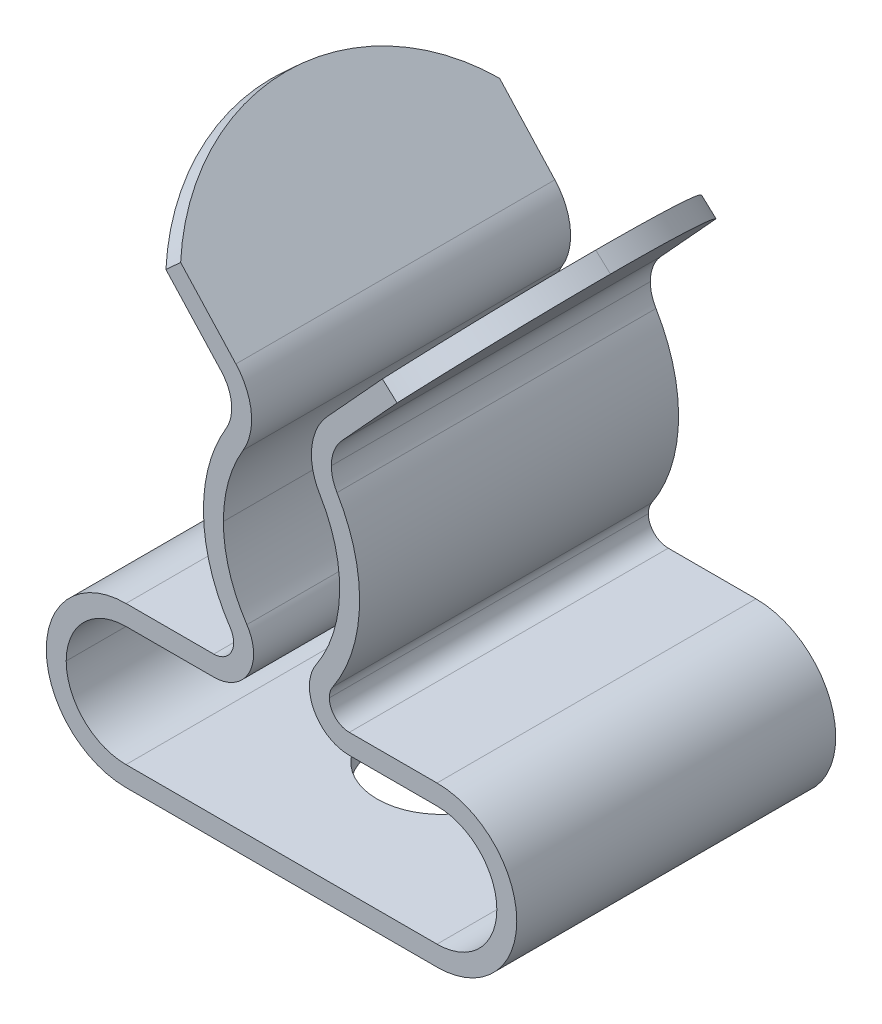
ISO-10303-21;
HEADER;
FILE_DESCRIPTION(('STEP AP214'),'2;1');
FILE_NAME('part.step','',(''),(''),'','','');
FILE_SCHEMA(('AUTOMOTIVE_DESIGN { 1 0 10303 214 1 1 1 1 }'));
ENDSEC;
DATA;
#1=APPLICATION_CONTEXT('core data for automotive mechanical design processes');
#2=APPLICATION_PROTOCOL_DEFINITION('international standard','automotive_design',2000,#1);
#3=PRODUCT_CONTEXT('',#1,'mechanical');
#4=PRODUCT('Part','Part','',(#3));
#5=PRODUCT_RELATED_PRODUCT_CATEGORY('part','',(#4));
#6=PRODUCT_DEFINITION_FORMATION('','',#4);
#7=PRODUCT_DEFINITION_CONTEXT('part definition',#1,'design');
#8=PRODUCT_DEFINITION('design','',#6,#7);
#9=PRODUCT_DEFINITION_SHAPE('','',#8);
#10=(LENGTH_UNIT() NAMED_UNIT(*) SI_UNIT(.MILLI.,.METRE.));
#11=(NAMED_UNIT(*) PLANE_ANGLE_UNIT() SI_UNIT($,.RADIAN.));
#12=(NAMED_UNIT(*) SI_UNIT($,.STERADIAN.) SOLID_ANGLE_UNIT());
#13=UNCERTAINTY_MEASURE_WITH_UNIT(LENGTH_MEASURE(1.E-05),#10,'distance_accuracy_value','');
#14=(GEOMETRIC_REPRESENTATION_CONTEXT(3) GLOBAL_UNCERTAINTY_ASSIGNED_CONTEXT((#13)) GLOBAL_UNIT_ASSIGNED_CONTEXT((#10,
#11,#12)) REPRESENTATION_CONTEXT('',''));
#15=CARTESIAN_POINT('',(0.,0.,0.));
#16=DIRECTION('',(0.,0.,1.));
#17=DIRECTION('',(1.,0.,0.));
#18=AXIS2_PLACEMENT_3D('',#15,#16,#17);
#19=CARTESIAN_POINT('',(0.,0.,4.));
#20=DIRECTION('',(0.,-1.,0.));
#21=DIRECTION('',(0.,0.,-1.));
#22=AXIS2_PLACEMENT_3D('',#19,#20,#21);
#23=CYLINDRICAL_SURFACE('',#22,1.6);
#24=DIRECTION('',(0.,-1.,0.));
#25=VECTOR('',#24,1.);
#26=CARTESIAN_POINT('',(0.,0.,5.6));
#27=LINE('',#26,#25);
#28=CARTESIAN_POINT('',(0.,0.5,5.6));
#29=VERTEX_POINT('',#28);
#30=CARTESIAN_POINT('',(0.,0.,5.6));
#31=VERTEX_POINT('',#30);
#32=EDGE_CURVE('E355',#29,#31,#27,.T.);
#33=ORIENTED_EDGE('',*,*,#32,.F.);
#34=CARTESIAN_POINT('',(0.,0.5,4.));
#35=DIRECTION('',(0.,1.,0.));
#36=DIRECTION('',(0.,0.,1.));
#37=AXIS2_PLACEMENT_3D('',#34,#35,#36);
#38=CIRCLE('',#37,1.6);
#39=CARTESIAN_POINT('',(0.,0.5,2.4));
#40=VERTEX_POINT('',#39);
#41=EDGE_CURVE('E350',#29,#40,#38,.T.);
#42=ORIENTED_EDGE('',*,*,#41,.T.);
#43=DIRECTION('',(0.,-1.,0.));
#44=VECTOR('',#43,1.);
#45=CARTESIAN_POINT('',(0.,0.,2.4));
#46=LINE('',#45,#44);
#47=CARTESIAN_POINT('',(0.,0.,2.4));
#48=VERTEX_POINT('',#47);
#49=EDGE_CURVE('E352',#40,#48,#46,.T.);
#50=ORIENTED_EDGE('',*,*,#49,.T.);
#51=CARTESIAN_POINT('',(0.,0.,4.));
#52=DIRECTION('',(0.,-1.,0.));
#53=DIRECTION('',(0.,0.,-1.));
#54=AXIS2_PLACEMENT_3D('',#51,#52,#53);
#55=CIRCLE('',#54,1.6);
#56=EDGE_CURVE('E475',#48,#31,#55,.T.);
#57=ORIENTED_EDGE('',*,*,#56,.T.);
#58=EDGE_LOOP('',(#33,#42,#50,#57));
#59=FACE_BOUND('',#58,.T.);
#60=ADVANCED_FACE('F15',(#59),#23,.F.);
#61=CARTESIAN_POINT('',(4.81352127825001,14.7517607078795,4.));
#62=DIRECTION('',(-0.737277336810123,-0.675590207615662,0.));
#63=DIRECTION('',(0.675590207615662,-0.737277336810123,0.));
#64=AXIS2_PLACEMENT_3D('',#61,#62,#63);
#65=CYLINDRICAL_SURFACE('',#64,5.);
#66=CARTESIAN_POINT('',(-0.50341029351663,9.87969055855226,4.));
#67=DIRECTION('',(-0.737277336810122,-0.675590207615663,0.));
#68=DIRECTION('',(-0.675590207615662,0.737277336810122,0.));
#69=AXIS2_PLACEMENT_3D('',#66,#67,#68);
#70=CIRCLE('',#69,5.);
#71=CARTESIAN_POINT('',(-2.53018091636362,12.0915225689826,8.));
#72=VERTEX_POINT('',#71);
#73=CARTESIAN_POINT('',(-2.53018091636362,12.0915225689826,0.));
#74=VERTEX_POINT('',#73);
#75=EDGE_CURVE('E412',#72,#74,#70,.T.);
#76=ORIENTED_EDGE('',*,*,#75,.T.);
#77=DIRECTION('',(-0.737277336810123,-0.675590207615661,0.));
#78=VECTOR('',#77,1.);
#79=CARTESIAN_POINT('',(2.78675065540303,16.9635927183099,0.));
#80=LINE('',#79,#78);
#81=CARTESIAN_POINT('',(-2.89881958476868,11.7537274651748,0.));
#82=VERTEX_POINT('',#81);
#83=EDGE_CURVE('E626',#74,#82,#80,.T.);
#84=ORIENTED_EDGE('',*,*,#83,.T.);
#85=CARTESIAN_POINT('',(-0.872048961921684,9.54189545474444,4.));
#86=DIRECTION('',(0.737277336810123,0.675590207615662,0.));
#87=DIRECTION('',(0.675590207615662,-0.737277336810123,0.));
#88=AXIS2_PLACEMENT_3D('',#85,#86,#87);
#89=CIRCLE('',#88,5.);
#90=CARTESIAN_POINT('',(-2.89881958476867,11.7537274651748,8.));
#91=VERTEX_POINT('',#90);
#92=EDGE_CURVE('E574',#82,#91,#89,.T.);
#93=ORIENTED_EDGE('',*,*,#92,.T.);
#94=DIRECTION('',(-0.737277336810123,-0.675590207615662,0.));
#95=VECTOR('',#94,1.);
#96=CARTESIAN_POINT('',(2.78675065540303,16.9635927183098,8.));
#97=LINE('',#96,#95);
#98=EDGE_CURVE('E498',#72,#91,#97,.T.);
#99=ORIENTED_EDGE('',*,*,#98,.F.);
#100=EDGE_LOOP('',(#76,#84,#93,#99));
#101=FACE_BOUND('',#100,.T.);
#102=ADVANCED_FACE('F823',(#101),#65,.T.);
#103=CARTESIAN_POINT('',(-4.81352127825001,14.7517607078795,4.));
#104=DIRECTION('',(0.737277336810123,-0.675590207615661,0.));
#105=DIRECTION('',(0.675590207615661,0.737277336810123,0.));
#106=AXIS2_PLACEMENT_3D('',#103,#104,#105);
#107=CYLINDRICAL_SURFACE('',#106,5.);
#108=DIRECTION('',(0.737277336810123,-0.675590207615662,0.));
#109=VECTOR('',#108,1.);
#110=CARTESIAN_POINT('',(-1.4355702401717,18.4381473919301,4.));
#111=LINE('',#110,#109);
#112=CARTESIAN_POINT('',(3.88136133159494,13.5660772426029,4.));
#113=VERTEX_POINT('',#112);
#114=CARTESIAN_POINT('',(4.25,13.228282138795,4.));
#115=VERTEX_POINT('',#114);
#116=EDGE_CURVE('E402',#113,#115,#111,.T.);
#117=ORIENTED_EDGE('',*,*,#116,.F.);
#118=CARTESIAN_POINT('',(0.503410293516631,9.87969055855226,4.));
#119=DIRECTION('',(0.737277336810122,-0.675590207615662,0.));
#120=DIRECTION('',(-0.675590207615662,-0.737277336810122,0.));
#121=AXIS2_PLACEMENT_3D('',#118,#119,#120);
#122=CIRCLE('',#121,5.);
#123=CARTESIAN_POINT('',(2.53018091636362,12.0915225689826,8.));
#124=VERTEX_POINT('',#123);
#125=EDGE_CURVE('E709',#113,#124,#122,.T.);
#126=ORIENTED_EDGE('',*,*,#125,.T.);
#127=DIRECTION('',(0.737277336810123,-0.675590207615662,0.));
#128=VECTOR('',#127,1.);
#129=CARTESIAN_POINT('',(-2.78675065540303,16.9635927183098,8.));
#130=LINE('',#129,#128);
#131=CARTESIAN_POINT('',(2.89881958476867,11.7537274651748,8.));
#132=VERTEX_POINT('',#131);
#133=EDGE_CURVE('E382',#124,#132,#130,.T.);
#134=ORIENTED_EDGE('',*,*,#133,.T.);
#135=CARTESIAN_POINT('',(0.872048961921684,9.54189545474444,4.));
#136=DIRECTION('',(-0.737277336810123,0.675590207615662,0.));
#137=DIRECTION('',(-0.675590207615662,-0.737277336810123,0.));
#138=AXIS2_PLACEMENT_3D('',#135,#136,#137);
#139=CIRCLE('',#138,5.);
#140=EDGE_CURVE('E434',#132,#115,#139,.T.);
#141=ORIENTED_EDGE('',*,*,#140,.T.);
#142=EDGE_LOOP('',(#117,#126,#134,#141));
#143=FACE_BOUND('',#142,.T.);
#144=ADVANCED_FACE('F827',(#143),#107,.T.);
#145=CARTESIAN_POINT('',(2.25,9.56547790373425,8.));
#146=DIRECTION('',(0.,0.,-1.));
#147=DIRECTION('',(-1.,0.,0.));
#148=AXIS2_PLACEMENT_3D('',#145,#146,#147);
#149=CYLINDRICAL_SURFACE('',#148,1.);
#150=DIRECTION('',(0.,0.,-1.));
#151=VECTOR('',#150,1.);
#152=CARTESIAN_POINT('',(1.25,9.56547790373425,8.));
#153=LINE('',#152,#151);
#154=CARTESIAN_POINT('',(1.25,9.56547790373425,8.));
#155=VERTEX_POINT('',#154);
#156=CARTESIAN_POINT('',(1.25,9.56547790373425,0.));
#157=VERTEX_POINT('',#156);
#158=EDGE_CURVE('E387',#155,#157,#153,.T.);
#159=ORIENTED_EDGE('',*,*,#158,.F.);
#160=CARTESIAN_POINT('',(2.25,9.56547790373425,8.));
#161=DIRECTION('',(0.,0.,-1.));
#162=DIRECTION('',(-1.,0.,0.));
#163=AXIS2_PLACEMENT_3D('',#160,#161,#162);
#164=CIRCLE('',#163,1.);
#165=CARTESIAN_POINT('',(1.39166852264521,9.0523823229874,8.));
#166=VERTEX_POINT('',#165);
#167=EDGE_CURVE('E546',#166,#155,#164,.T.);
#168=ORIENTED_EDGE('',*,*,#167,.F.);
#169=DIRECTION('',(0.,0.,-1.));
#170=VECTOR('',#169,1.);
#171=CARTESIAN_POINT('',(1.39166852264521,9.0523823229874,8.));
#172=LINE('',#171,#170);
#173=CARTESIAN_POINT('',(1.39166852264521,9.0523823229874,0.));
#174=VERTEX_POINT('',#173);
#175=EDGE_CURVE('E9',#166,#174,#172,.T.);
#176=ORIENTED_EDGE('',*,*,#175,.T.);
#177=CARTESIAN_POINT('',(2.25,9.56547790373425,0.));
#178=DIRECTION('',(0.,0.,-1.));
#179=DIRECTION('',(-1.,0.,0.));
#180=AXIS2_PLACEMENT_3D('',#177,#178,#179);
#181=CIRCLE('',#180,1.);
#182=EDGE_CURVE('E383',#174,#157,#181,.T.);
#183=ORIENTED_EDGE('',*,*,#182,.T.);
#184=EDGE_LOOP('',(#159,#168,#176,#183));
#185=FACE_BOUND('',#184,.T.);
#186=ADVANCED_FACE('F832',(#185),#149,.F.);
#187=CARTESIAN_POINT('',(-2.04165738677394,7.,8.));
#188=DIRECTION('',(0.,0.,-1.));
#189=DIRECTION('',(-1.,0.,0.));
#190=AXIS2_PLACEMENT_3D('',#187,#188,#189);
#191=CYLINDRICAL_SURFACE('',#190,4.);
#192=CARTESIAN_POINT('',(-2.04165738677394,7.,0.));
#193=DIRECTION('',(0.,0.,1.));
#194=DIRECTION('',(1.,0.,0.));
#195=AXIS2_PLACEMENT_3D('',#192,#193,#194);
#196=CIRCLE('',#195,4.);
#197=CARTESIAN_POINT('',(1.28426029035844,4.77777777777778,0.));
#198=VERTEX_POINT('',#197);
#199=EDGE_CURVE('E384',#198,#174,#196,.T.);
#200=ORIENTED_EDGE('',*,*,#199,.T.);
#201=ORIENTED_EDGE('',*,*,#175,.F.);
#202=CARTESIAN_POINT('',(-2.04165738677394,7.,8.));
#203=DIRECTION('',(0.,0.,1.));
#204=DIRECTION('',(1.,0.,0.));
#205=AXIS2_PLACEMENT_3D('',#202,#203,#204);
#206=CIRCLE('',#205,4.);
#207=CARTESIAN_POINT('',(1.28426029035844,4.77777777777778,8.));
#208=VERTEX_POINT('',#207);
#209=EDGE_CURVE('E542',#208,#166,#206,.T.);
#210=ORIENTED_EDGE('',*,*,#209,.F.);
#211=DIRECTION('',(0.,0.,-1.));
#212=VECTOR('',#211,1.);
#213=CARTESIAN_POINT('',(1.28426029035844,4.77777777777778,8.));
#214=LINE('',#213,#212);
#215=EDGE_CURVE('E439',#208,#198,#214,.T.);
#216=ORIENTED_EDGE('',*,*,#215,.T.);
#217=EDGE_LOOP('',(#200,#201,#210,#216));
#218=FACE_BOUND('',#217,.T.);
#219=ADVANCED_FACE('F838',(#218),#191,.T.);
#220=CARTESIAN_POINT('',(1.7,4.5,8.));
#221=DIRECTION('',(0.,0.,-1.));
#222=DIRECTION('',(-1.,0.,0.));
#223=AXIS2_PLACEMENT_3D('',#220,#221,#222);
#224=CYLINDRICAL_SURFACE('',#223,0.5);
#225=DIRECTION('',(0.,0.,-1.));
#226=VECTOR('',#225,1.);
#227=CARTESIAN_POINT('',(1.2,4.5,8.));
#228=LINE('',#227,#226);
#229=CARTESIAN_POINT('',(1.2,4.5,8.));
#230=VERTEX_POINT('',#229);
#231=CARTESIAN_POINT('',(1.2,4.5,0.));
#232=VERTEX_POINT('',#231);
#233=EDGE_CURVE('E418',#230,#232,#228,.T.);
#234=ORIENTED_EDGE('',*,*,#233,.F.);
#235=CARTESIAN_POINT('',(1.7,4.5,8.));
#236=DIRECTION('',(0.,0.,-1.));
#237=DIRECTION('',(-1.,0.,0.));
#238=AXIS2_PLACEMENT_3D('',#235,#236,#237);
#239=CIRCLE('',#238,0.5);
#240=CARTESIAN_POINT('',(1.7,4.,8.));
#241=VERTEX_POINT('',#240);
#242=EDGE_CURVE('E547',#241,#230,#239,.T.);
#243=ORIENTED_EDGE('',*,*,#242,.F.);
#244=DIRECTION('',(0.,0.,-1.));
#245=VECTOR('',#244,1.);
#246=CARTESIAN_POINT('',(1.7,4.,8.));
#247=LINE('',#246,#245);
#248=CARTESIAN_POINT('',(1.7,4.,0.));
#249=VERTEX_POINT('',#248);
#250=EDGE_CURVE('E18',#241,#249,#247,.T.);
#251=ORIENTED_EDGE('',*,*,#250,.T.);
#252=CARTESIAN_POINT('',(1.7,4.5,0.));
#253=DIRECTION('',(0.,0.,-1.));
#254=DIRECTION('',(-1.,0.,0.));
#255=AXIS2_PLACEMENT_3D('',#252,#253,#254);
#256=CIRCLE('',#255,0.5);
#257=EDGE_CURVE('E533',#249,#232,#256,.T.);
#258=ORIENTED_EDGE('',*,*,#257,.T.);
#259=EDGE_LOOP('',(#234,#243,#251,#258));
#260=FACE_BOUND('',#259,.T.);
#261=ADVANCED_FACE('F842',(#260),#224,.F.);
#262=CARTESIAN_POINT('',(3.9,4.,8.));
#263=DIRECTION('',(0.,-1.,0.));
#264=DIRECTION('',(0.,0.,-1.));
#265=AXIS2_PLACEMENT_3D('',#262,#263,#264);
#266=PLANE('',#265);
#267=DIRECTION('',(-1.,0.,0.));
#268=VECTOR('',#267,1.);
#269=CARTESIAN_POINT('',(3.9,4.,0.));
#270=LINE('',#269,#268);
#271=CARTESIAN_POINT('',(3.9,4.,0.));
#272=VERTEX_POINT('',#271);
#273=EDGE_CURVE('E749',#272,#249,#270,.T.);
#274=ORIENTED_EDGE('',*,*,#273,.T.);
#275=ORIENTED_EDGE('',*,*,#250,.F.);
#276=DIRECTION('',(-1.,0.,0.));
#277=VECTOR('',#276,1.);
#278=CARTESIAN_POINT('',(3.9,4.,8.));
#279=LINE('',#278,#277);
#280=CARTESIAN_POINT('',(3.9,4.,8.));
#281=VERTEX_POINT('',#280);
#282=EDGE_CURVE('E663',#281,#241,#279,.T.);
#283=ORIENTED_EDGE('',*,*,#282,.F.);
#284=DIRECTION('',(0.,0.,-1.));
#285=VECTOR('',#284,1.);
#286=CARTESIAN_POINT('',(3.9,4.,8.));
#287=LINE('',#286,#285);
#288=EDGE_CURVE('E478',#281,#272,#287,.T.);
#289=ORIENTED_EDGE('',*,*,#288,.T.);
#290=EDGE_LOOP('',(#274,#275,#283,#289));
#291=FACE_BOUND('',#290,.T.);
#292=ADVANCED_FACE('F792',(#291),#266,.F.);
#293=CARTESIAN_POINT('',(3.9,2.,8.));
#294=DIRECTION('',(0.,0.,-1.));
#295=DIRECTION('',(-1.,0.,0.));
#296=AXIS2_PLACEMENT_3D('',#293,#294,#295);
#297=CYLINDRICAL_SURFACE('',#296,2.);
#298=CARTESIAN_POINT('',(3.9,2.,0.));
#299=DIRECTION('',(0.,0.,1.));
#300=DIRECTION('',(1.,0.,0.));
#301=AXIS2_PLACEMENT_3D('',#298,#299,#300);
#302=CIRCLE('',#301,2.);
#303=CARTESIAN_POINT('',(3.9,0.,0.));
#304=VERTEX_POINT('',#303);
#305=EDGE_CURVE('E753',#304,#272,#302,.T.);
#306=ORIENTED_EDGE('',*,*,#305,.T.);
#307=ORIENTED_EDGE('',*,*,#288,.F.);
#308=CARTESIAN_POINT('',(3.9,2.,8.));
#309=DIRECTION('',(0.,0.,1.));
#310=DIRECTION('',(1.,0.,0.));
#311=AXIS2_PLACEMENT_3D('',#308,#309,#310);
#312=CIRCLE('',#311,2.);
#313=CARTESIAN_POINT('',(3.9,0.,8.));
#314=VERTEX_POINT('',#313);
#315=EDGE_CURVE('E659',#314,#281,#312,.T.);
#316=ORIENTED_EDGE('',*,*,#315,.F.);
#317=DIRECTION('',(0.,0.,-1.));
#318=VECTOR('',#317,1.);
#319=CARTESIAN_POINT('',(3.9,0.,8.));
#320=LINE('',#319,#318);
#321=EDGE_CURVE('E479',#314,#304,#320,.T.);
#322=ORIENTED_EDGE('',*,*,#321,.T.);
#323=EDGE_LOOP('',(#306,#307,#316,#322));
#324=FACE_BOUND('',#323,.T.);
#325=ADVANCED_FACE('F779',(#324),#297,.T.);
#326=CARTESIAN_POINT('',(3.9,0.,8.));
#327=DIRECTION('',(0.,1.,0.));
#328=DIRECTION('',(1.,0.,0.));
#329=AXIS2_PLACEMENT_3D('',#326,#327,#328);
#330=PLANE('',#329);
#331=ORIENTED_EDGE('',*,*,#56,.F.);
#332=CARTESIAN_POINT('',(0.,0.,4.));
#333=DIRECTION('',(0.,-1.,0.));
#334=DIRECTION('',(0.,0.,-1.));
#335=AXIS2_PLACEMENT_3D('',#332,#333,#334);
#336=CIRCLE('',#335,1.6);
#337=EDGE_CURVE('E367',#31,#48,#336,.T.);
#338=ORIENTED_EDGE('',*,*,#337,.F.);
#339=EDGE_LOOP('',(#331,#338));
#340=FACE_BOUND('',#339,.T.);
#341=DIRECTION('',(1.,0.,0.));
#342=VECTOR('',#341,1.);
#343=CARTESIAN_POINT('',(3.9,0.,0.));
#344=LINE('',#343,#342);
#345=CARTESIAN_POINT('',(-3.9,0.,0.));
#346=VERTEX_POINT('',#345);
#347=EDGE_CURVE('E757',#346,#304,#344,.T.);
#348=ORIENTED_EDGE('',*,*,#347,.T.);
#349=ORIENTED_EDGE('',*,*,#321,.F.);
#350=DIRECTION('',(1.,0.,0.));
#351=VECTOR('',#350,1.);
#352=CARTESIAN_POINT('',(3.9,0.,8.));
#353=LINE('',#352,#351);
#354=CARTESIAN_POINT('',(-3.9,0.,8.));
#355=VERTEX_POINT('',#354);
#356=EDGE_CURVE('E653',#355,#314,#353,.T.);
#357=ORIENTED_EDGE('',*,*,#356,.F.);
#358=DIRECTION('',(0.,0.,-1.));
#359=VECTOR('',#358,1.);
#360=CARTESIAN_POINT('',(-3.9,0.,8.));
#361=LINE('',#360,#359);
#362=EDGE_CURVE('E489',#355,#346,#361,.T.);
#363=ORIENTED_EDGE('',*,*,#362,.T.);
#364=EDGE_LOOP('',(#348,#349,#357,#363));
#365=FACE_BOUND('',#364,.T.);
#366=ADVANCED_FACE('F783',(#340,#365),#330,.F.);
#367=CARTESIAN_POINT('',(-3.9,2.,8.));
#368=DIRECTION('',(0.,0.,-1.));
#369=DIRECTION('',(-1.,0.,0.));
#370=AXIS2_PLACEMENT_3D('',#367,#368,#369);
#371=CYLINDRICAL_SURFACE('',#370,2.);
#372=DIRECTION('',(0.,0.,-1.));
#373=VECTOR('',#372,1.);
#374=CARTESIAN_POINT('',(-5.9,2.,8.));
#375=LINE('',#374,#373);
#376=CARTESIAN_POINT('',(-5.9,2.,8.));
#377=VERTEX_POINT('',#376);
#378=CARTESIAN_POINT('',(-5.9,2.,0.));
#379=VERTEX_POINT('',#378);
#380=EDGE_CURVE('E470',#377,#379,#375,.T.);
#381=ORIENTED_EDGE('',*,*,#380,.F.);
#382=CARTESIAN_POINT('',(-3.9,2.,8.));
#383=DIRECTION('',(0.,0.,1.));
#384=DIRECTION('',(-1.,0.,0.));
#385=AXIS2_PLACEMENT_3D('',#382,#383,#384);
#386=CIRCLE('',#385,2.);
#387=CARTESIAN_POINT('',(-3.9,4.,8.));
#388=VERTEX_POINT('',#387);
#389=EDGE_CURVE('E650',#388,#377,#386,.T.);
#390=ORIENTED_EDGE('',*,*,#389,.F.);
#391=DIRECTION('',(0.,0.,-1.));
#392=VECTOR('',#391,1.);
#393=CARTESIAN_POINT('',(-3.9,4.,8.));
#394=LINE('',#393,#392);
#395=CARTESIAN_POINT('',(-3.9,4.,0.));
#396=VERTEX_POINT('',#395);
#397=EDGE_CURVE('E721',#388,#396,#394,.T.);
#398=ORIENTED_EDGE('',*,*,#397,.T.);
#399=CARTESIAN_POINT('',(-3.9,2.,0.));
#400=DIRECTION('',(0.,0.,1.));
#401=DIRECTION('',(-1.,0.,0.));
#402=AXIS2_PLACEMENT_3D('',#399,#400,#401);
#403=CIRCLE('',#402,2.);
#404=EDGE_CURVE('E407',#396,#379,#403,.T.);
#405=ORIENTED_EDGE('',*,*,#404,.T.);
#406=EDGE_LOOP('',(#381,#390,#398,#405));
#407=FACE_BOUND('',#406,.T.);
#408=ADVANCED_FACE('F805',(#407),#371,.T.);
#409=CARTESIAN_POINT('',(-3.9,4.,8.));
#410=DIRECTION('',(0.,-1.,0.));
#411=DIRECTION('',(-1.,0.,0.));
#412=AXIS2_PLACEMENT_3D('',#409,#410,#411);
#413=PLANE('',#412);
#414=DIRECTION('',(-1.,0.,0.));
#415=VECTOR('',#414,1.);
#416=CARTESIAN_POINT('',(-3.9,4.,0.));
#417=LINE('',#416,#415);
#418=CARTESIAN_POINT('',(-1.7,4.,0.));
#419=VERTEX_POINT('',#418);
#420=EDGE_CURVE('E403',#419,#396,#417,.T.);
#421=ORIENTED_EDGE('',*,*,#420,.T.);
#422=ORIENTED_EDGE('',*,*,#397,.F.);
#423=DIRECTION('',(-1.,0.,0.));
#424=VECTOR('',#423,1.);
#425=CARTESIAN_POINT('',(-3.9,4.,8.));
#426=LINE('',#425,#424);
#427=CARTESIAN_POINT('',(-1.7,4.,8.));
#428=VERTEX_POINT('',#427);
#429=EDGE_CURVE('E645',#428,#388,#426,.T.);
#430=ORIENTED_EDGE('',*,*,#429,.F.);
#431=DIRECTION('',(0.,0.,-1.));
#432=VECTOR('',#431,1.);
#433=CARTESIAN_POINT('',(-1.7,4.,8.));
#434=LINE('',#433,#432);
#435=EDGE_CURVE('E45',#428,#419,#434,.T.);
#436=ORIENTED_EDGE('',*,*,#435,.T.);
#437=EDGE_LOOP('',(#421,#422,#430,#436));
#438=FACE_BOUND('',#437,.T.);
#439=ADVANCED_FACE('F807',(#438),#413,.F.);
#440=CARTESIAN_POINT('',(-1.7,4.5,8.));
#441=DIRECTION('',(0.,0.,-1.));
#442=DIRECTION('',(-1.,0.,0.));
#443=AXIS2_PLACEMENT_3D('',#440,#441,#442);
#444=CYLINDRICAL_SURFACE('',#443,0.5);
#445=CARTESIAN_POINT('',(-1.7,4.5,0.));
#446=DIRECTION('',(0.,0.,-1.));
#447=DIRECTION('',(1.,0.,0.));
#448=AXIS2_PLACEMENT_3D('',#445,#446,#447);
#449=CIRCLE('',#448,0.5);
#450=CARTESIAN_POINT('',(-1.28426029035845,4.77777777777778,0.));
#451=VERTEX_POINT('',#450);
#452=EDGE_CURVE('E406',#451,#419,#449,.T.);
#453=ORIENTED_EDGE('',*,*,#452,.T.);
#454=ORIENTED_EDGE('',*,*,#435,.F.);
#455=CARTESIAN_POINT('',(-1.7,4.5,8.));
#456=DIRECTION('',(0.,0.,-1.));
#457=DIRECTION('',(1.,0.,0.));
#458=AXIS2_PLACEMENT_3D('',#455,#456,#457);
#459=CIRCLE('',#458,0.5);
#460=CARTESIAN_POINT('',(-1.28426029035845,4.77777777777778,8.));
#461=VERTEX_POINT('',#460);
#462=EDGE_CURVE('E639',#461,#428,#459,.T.);
#463=ORIENTED_EDGE('',*,*,#462,.F.);
#464=DIRECTION('',(0.,0.,-1.));
#465=VECTOR('',#464,1.);
#466=CARTESIAN_POINT('',(-1.28426029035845,4.77777777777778,8.));
#467=LINE('',#466,#465);
#468=EDGE_CURVE('E510',#461,#451,#467,.T.);
#469=ORIENTED_EDGE('',*,*,#468,.T.);
#470=EDGE_LOOP('',(#453,#454,#463,#469));
#471=FACE_BOUND('',#470,.T.);
#472=ADVANCED_FACE('F809',(#471),#444,.F.);
#473=CARTESIAN_POINT('',(2.04165738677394,7.,8.));
#474=DIRECTION('',(0.,0.,-1.));
#475=DIRECTION('',(-1.,0.,0.));
#476=AXIS2_PLACEMENT_3D('',#473,#474,#475);
#477=CYLINDRICAL_SURFACE('',#476,4.);
#478=DIRECTION('',(0.,0.,-1.));
#479=VECTOR('',#478,1.);
#480=CARTESIAN_POINT('',(-1.95834261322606,7.,8.));
#481=LINE('',#480,#479);
#482=CARTESIAN_POINT('',(-1.95834261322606,7.,8.));
#483=VERTEX_POINT('',#482);
#484=CARTESIAN_POINT('',(-1.95834261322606,7.,0.));
#485=VERTEX_POINT('',#484);
#486=EDGE_CURVE('E497',#483,#485,#481,.T.);
#487=ORIENTED_EDGE('',*,*,#486,.F.);
#488=CARTESIAN_POINT('',(2.04165738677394,7.,8.));
#489=DIRECTION('',(0.,0.,1.));
#490=DIRECTION('',(-1.,0.,0.));
#491=AXIS2_PLACEMENT_3D('',#488,#489,#490);
#492=CIRCLE('',#491,4.);
#493=CARTESIAN_POINT('',(-1.39166852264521,9.0523823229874,8.));
#494=VERTEX_POINT('',#493);
#495=EDGE_CURVE('E636',#494,#483,#492,.T.);
#496=ORIENTED_EDGE('',*,*,#495,.F.);
#497=DIRECTION('',(0.,0.,-1.));
#498=VECTOR('',#497,1.);
#499=CARTESIAN_POINT('',(-1.39166852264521,9.0523823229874,8.));
#500=LINE('',#499,#498);
#501=CARTESIAN_POINT('',(-1.39166852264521,9.0523823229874,0.));
#502=VERTEX_POINT('',#501);
#503=EDGE_CURVE('E35',#494,#502,#500,.T.);
#504=ORIENTED_EDGE('',*,*,#503,.T.);
#505=CARTESIAN_POINT('',(2.04165738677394,7.,0.));
#506=DIRECTION('',(0.,0.,1.));
#507=DIRECTION('',(-1.,0.,0.));
#508=AXIS2_PLACEMENT_3D('',#505,#506,#507);
#509=CIRCLE('',#508,4.);
#510=EDGE_CURVE('E426',#502,#485,#509,.T.);
#511=ORIENTED_EDGE('',*,*,#510,.T.);
#512=EDGE_LOOP('',(#487,#496,#504,#511));
#513=FACE_BOUND('',#512,.T.);
#514=ADVANCED_FACE('F816',(#513),#477,.T.);
#515=CARTESIAN_POINT('',(-2.25,9.56547790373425,8.));
#516=DIRECTION('',(0.,0.,-1.));
#517=DIRECTION('',(-1.,0.,0.));
#518=AXIS2_PLACEMENT_3D('',#515,#516,#517);
#519=CYLINDRICAL_SURFACE('',#518,1.);
#520=CARTESIAN_POINT('',(-2.25,9.56547790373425,0.));
#521=DIRECTION('',(0.,0.,-1.));
#522=DIRECTION('',(1.,0.,0.));
#523=AXIS2_PLACEMENT_3D('',#520,#521,#522);
#524=CIRCLE('',#523,1.);
#525=CARTESIAN_POINT('',(-1.51272266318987,10.2410681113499,0.));
#526=VERTEX_POINT('',#525);
#527=EDGE_CURVE('E565',#526,#502,#524,.T.);
#528=ORIENTED_EDGE('',*,*,#527,.T.);
#529=ORIENTED_EDGE('',*,*,#503,.F.);
#530=CARTESIAN_POINT('',(-2.25,9.56547790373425,8.));
#531=DIRECTION('',(0.,0.,-1.));
#532=DIRECTION('',(1.,0.,0.));
#533=AXIS2_PLACEMENT_3D('',#530,#531,#532);
#534=CIRCLE('',#533,1.);
#535=CARTESIAN_POINT('',(-1.51272266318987,10.2410681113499,8.));
#536=VERTEX_POINT('',#535);
#537=EDGE_CURVE('E501',#536,#494,#534,.T.);
#538=ORIENTED_EDGE('',*,*,#537,.F.);
#539=DIRECTION('',(0.,0.,-1.));
#540=VECTOR('',#539,1.);
#541=CARTESIAN_POINT('',(-1.51272266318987,10.2410681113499,8.));
#542=LINE('',#541,#540);
#543=EDGE_CURVE('E502',#536,#526,#542,.T.);
#544=ORIENTED_EDGE('',*,*,#543,.T.);
#545=EDGE_LOOP('',(#528,#529,#538,#544));
#546=FACE_BOUND('',#545,.T.);
#547=ADVANCED_FACE('F856',(#546),#519,.F.);
#548=CARTESIAN_POINT('',(-2.25,9.56547790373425,8.));
#549=DIRECTION('',(0.,0.,-1.));
#550=DIRECTION('',(-1.,0.,0.));
#551=AXIS2_PLACEMENT_3D('',#548,#549,#550);
#552=CYLINDRICAL_SURFACE('',#551,1.5);
#553=CARTESIAN_POINT('',(-2.25,9.56547790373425,0.));
#554=DIRECTION('',(0.,0.,-1.));
#555=DIRECTION('',(1.,0.,0.));
#556=AXIS2_PLACEMENT_3D('',#553,#554,#555);
#557=CIRCLE('',#556,1.5);
#558=CARTESIAN_POINT('',(-1.14408399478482,10.5788632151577,0.));
#559=VERTEX_POINT('',#558);
#560=CARTESIAN_POINT('',(-0.962502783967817,8.79583453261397,0.));
#561=VERTEX_POINT('',#560);
#562=EDGE_CURVE('E485',#559,#561,#557,.T.);
#563=ORIENTED_EDGE('',*,*,#562,.F.);
#564=DIRECTION('',(0.,0.,-1.));
#565=VECTOR('',#564,1.);
#566=CARTESIAN_POINT('',(-1.14408399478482,10.5788632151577,8.));
#567=LINE('',#566,#565);
#568=CARTESIAN_POINT('',(-1.14408399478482,10.5788632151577,8.));
#569=VERTEX_POINT('',#568);
#570=EDGE_CURVE('E611',#569,#559,#567,.T.);
#571=ORIENTED_EDGE('',*,*,#570,.F.);
#572=CARTESIAN_POINT('',(-2.25,9.56547790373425,8.));
#573=DIRECTION('',(0.,0.,-1.));
#574=DIRECTION('',(1.,0.,0.));
#575=AXIS2_PLACEMENT_3D('',#572,#573,#574);
#576=CIRCLE('',#575,1.5);
#577=CARTESIAN_POINT('',(-0.962502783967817,8.79583453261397,8.));
#578=VERTEX_POINT('',#577);
#579=EDGE_CURVE('E435',#569,#578,#576,.T.);
#580=ORIENTED_EDGE('',*,*,#579,.T.);
#581=DIRECTION('',(0.,0.,-1.));
#582=VECTOR('',#581,1.);
#583=CARTESIAN_POINT('',(-0.962502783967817,8.79583453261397,8.));
#584=LINE('',#583,#582);
#585=EDGE_CURVE('E529',#578,#561,#584,.T.);
#586=ORIENTED_EDGE('',*,*,#585,.T.);
#587=EDGE_LOOP('',(#563,#571,#580,#586));
#588=FACE_BOUND('',#587,.T.);
#589=ADVANCED_FACE('F859',(#588),#552,.T.);
#590=CARTESIAN_POINT('',(2.04165738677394,7.,8.));
#591=DIRECTION('',(0.,0.,-1.));
#592=DIRECTION('',(-1.,0.,0.));
#593=AXIS2_PLACEMENT_3D('',#590,#591,#592);
#594=CYLINDRICAL_SURFACE('',#593,3.5);
#595=DIRECTION('',(0.,0.,-1.));
#596=VECTOR('',#595,1.);
#597=CARTESIAN_POINT('',(-1.45834261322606,7.,8.));
#598=LINE('',#597,#596);
#599=CARTESIAN_POINT('',(-1.45834261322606,7.,8.));
#600=VERTEX_POINT('',#599);
#601=CARTESIAN_POINT('',(-1.45834261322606,7.,0.));
#602=VERTEX_POINT('',#601);
#603=EDGE_CURVE('E521',#600,#602,#598,.T.);
#604=ORIENTED_EDGE('',*,*,#603,.F.);
#605=CARTESIAN_POINT('',(2.04165738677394,7.,8.));
#606=DIRECTION('',(0.,0.,1.));
#607=DIRECTION('',(1.,0.,0.));
#608=AXIS2_PLACEMENT_3D('',#605,#606,#607);
#609=CIRCLE('',#608,3.5);
#610=CARTESIAN_POINT('',(-0.868520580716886,5.05555555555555,8.));
#611=VERTEX_POINT('',#610);
#612=EDGE_CURVE('E517',#600,#611,#609,.T.);
#613=ORIENTED_EDGE('',*,*,#612,.T.);
#614=DIRECTION('',(0.,0.,-1.));
#615=VECTOR('',#614,1.);
#616=CARTESIAN_POINT('',(-0.868520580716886,5.05555555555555,8.));
#617=LINE('',#616,#615);
#618=CARTESIAN_POINT('',(-0.868520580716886,5.05555555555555,0.));
#619=VERTEX_POINT('',#618);
#620=EDGE_CURVE('E446',#611,#619,#617,.T.);
#621=ORIENTED_EDGE('',*,*,#620,.T.);
#622=CARTESIAN_POINT('',(2.04165738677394,7.,0.));
#623=DIRECTION('',(0.,0.,1.));
#624=DIRECTION('',(1.,0.,0.));
#625=AXIS2_PLACEMENT_3D('',#622,#623,#624);
#626=CIRCLE('',#625,3.5);
#627=EDGE_CURVE('E480',#602,#619,#626,.T.);
#628=ORIENTED_EDGE('',*,*,#627,.F.);
#629=EDGE_LOOP('',(#604,#613,#621,#628));
#630=FACE_BOUND('',#629,.T.);
#631=ADVANCED_FACE('F861',(#630),#594,.F.);
#632=CARTESIAN_POINT('',(-1.7,4.5,8.));
#633=DIRECTION('',(0.,0.,-1.));
#634=DIRECTION('',(-1.,0.,0.));
#635=AXIS2_PLACEMENT_3D('',#632,#633,#634);
#636=CYLINDRICAL_SURFACE('',#635,1.);
#637=CARTESIAN_POINT('',(-1.7,4.5,0.));
#638=DIRECTION('',(0.,0.,-1.));
#639=DIRECTION('',(1.,0.,0.));
#640=AXIS2_PLACEMENT_3D('',#637,#638,#639);
#641=CIRCLE('',#640,1.);
#642=CARTESIAN_POINT('',(-1.7,3.5,0.));
#643=VERTEX_POINT('',#642);
#644=EDGE_CURVE('E484',#619,#643,#641,.T.);
#645=ORIENTED_EDGE('',*,*,#644,.F.);
#646=ORIENTED_EDGE('',*,*,#620,.F.);
#647=CARTESIAN_POINT('',(-1.7,4.5,8.));
#648=DIRECTION('',(0.,0.,-1.));
#649=DIRECTION('',(1.,0.,0.));
#650=AXIS2_PLACEMENT_3D('',#647,#648,#649);
#651=CIRCLE('',#650,1.);
#652=CARTESIAN_POINT('',(-1.7,3.5,8.));
#653=VERTEX_POINT('',#652);
#654=EDGE_CURVE('E693',#611,#653,#651,.T.);
#655=ORIENTED_EDGE('',*,*,#654,.T.);
#656=DIRECTION('',(0.,0.,-1.));
#657=VECTOR('',#656,1.);
#658=CARTESIAN_POINT('',(-1.7,3.5,8.));
#659=LINE('',#658,#657);
#660=EDGE_CURVE('E360',#653,#643,#659,.T.);
#661=ORIENTED_EDGE('',*,*,#660,.T.);
#662=EDGE_LOOP('',(#645,#646,#655,#661));
#663=FACE_BOUND('',#662,.T.);
#664=ADVANCED_FACE('F864',(#663),#636,.T.);
#665=CARTESIAN_POINT('',(-3.9,3.5,8.));
#666=DIRECTION('',(0.,-1.,0.));
#667=DIRECTION('',(-1.,0.,0.));
#668=AXIS2_PLACEMENT_3D('',#665,#666,#667);
#669=PLANE('',#668);
#670=DIRECTION('',(-1.,0.,0.));
#671=VECTOR('',#670,1.);
#672=CARTESIAN_POINT('',(-3.9,3.5,0.));
#673=LINE('',#672,#671);
#674=CARTESIAN_POINT('',(-3.9,3.5,0.));
#675=VERTEX_POINT('',#674);
#676=EDGE_CURVE('E717',#643,#675,#673,.T.);
#677=ORIENTED_EDGE('',*,*,#676,.F.);
#678=ORIENTED_EDGE('',*,*,#660,.F.);
#679=DIRECTION('',(-1.,0.,0.));
#680=VECTOR('',#679,1.);
#681=CARTESIAN_POINT('',(-3.9,3.5,8.));
#682=LINE('',#681,#680);
#683=CARTESIAN_POINT('',(-3.9,3.5,8.));
#684=VERTEX_POINT('',#683);
#685=EDGE_CURVE('E690',#653,#684,#682,.T.);
#686=ORIENTED_EDGE('',*,*,#685,.T.);
#687=DIRECTION('',(0.,0.,-1.));
#688=VECTOR('',#687,1.);
#689=CARTESIAN_POINT('',(-3.9,3.5,8.));
#690=LINE('',#689,#688);
#691=EDGE_CURVE('E558',#684,#675,#690,.T.);
#692=ORIENTED_EDGE('',*,*,#691,.T.);
#693=EDGE_LOOP('',(#677,#678,#686,#692));
#694=FACE_BOUND('',#693,.T.);
#695=ADVANCED_FACE('F868',(#694),#669,.T.);
#696=CARTESIAN_POINT('',(-3.9,2.,8.));
#697=DIRECTION('',(0.,0.,-1.));
#698=DIRECTION('',(-1.,0.,0.));
#699=AXIS2_PLACEMENT_3D('',#696,#697,#698);
#700=CYLINDRICAL_SURFACE('',#699,1.5);
#701=DIRECTION('',(0.,0.,-1.));
#702=VECTOR('',#701,1.);
#703=CARTESIAN_POINT('',(-5.4,2.,8.));
#704=LINE('',#703,#702);
#705=CARTESIAN_POINT('',(-5.4,2.,8.));
#706=VERTEX_POINT('',#705);
#707=CARTESIAN_POINT('',(-5.4,2.,0.));
#708=VERTEX_POINT('',#707);
#709=EDGE_CURVE('E541',#706,#708,#704,.T.);
#710=ORIENTED_EDGE('',*,*,#709,.F.);
#711=CARTESIAN_POINT('',(-3.9,2.,8.));
#712=DIRECTION('',(0.,0.,1.));
#713=DIRECTION('',(1.,0.,0.));
#714=AXIS2_PLACEMENT_3D('',#711,#712,#713);
#715=CIRCLE('',#714,1.5);
#716=CARTESIAN_POINT('',(-3.9,0.5,8.));
#717=VERTEX_POINT('',#716);
#718=EDGE_CURVE('E592',#706,#717,#715,.T.);
#719=ORIENTED_EDGE('',*,*,#718,.T.);
#720=DIRECTION('',(0.,0.,-1.));
#721=VECTOR('',#720,1.);
#722=CARTESIAN_POINT('',(-3.9,0.5,8.));
#723=LINE('',#722,#721);
#724=CARTESIAN_POINT('',(-3.9,0.5,0.));
#725=VERTEX_POINT('',#724);
#726=EDGE_CURVE('E361',#717,#725,#723,.T.);
#727=ORIENTED_EDGE('',*,*,#726,.T.);
#728=CARTESIAN_POINT('',(-3.9,2.,0.));
#729=DIRECTION('',(0.,0.,1.));
#730=DIRECTION('',(1.,0.,0.));
#731=AXIS2_PLACEMENT_3D('',#728,#729,#730);
#732=CIRCLE('',#731,1.5);
#733=EDGE_CURVE('E720',#708,#725,#732,.T.);
#734=ORIENTED_EDGE('',*,*,#733,.F.);
#735=EDGE_LOOP('',(#710,#719,#727,#734));
#736=FACE_BOUND('',#735,.T.);
#737=ADVANCED_FACE('F870',(#736),#700,.F.);
#738=CARTESIAN_POINT('',(3.9,0.5,8.));
#739=DIRECTION('',(0.,1.,0.));
#740=DIRECTION('',(1.,0.,0.));
#741=AXIS2_PLACEMENT_3D('',#738,#739,#740);
#742=PLANE('',#741);
#743=CARTESIAN_POINT('',(0.,0.5,4.));
#744=DIRECTION('',(0.,1.,0.));
#745=DIRECTION('',(0.,0.,1.));
#746=AXIS2_PLACEMENT_3D('',#743,#744,#745);
#747=CIRCLE('',#746,1.6);
#748=EDGE_CURVE('E365',#40,#29,#747,.T.);
#749=ORIENTED_EDGE('',*,*,#748,.F.);
#750=ORIENTED_EDGE('',*,*,#41,.F.);
#751=EDGE_LOOP('',(#749,#750));
#752=FACE_BOUND('',#751,.T.);
#753=DIRECTION('',(1.,0.,0.));
#754=VECTOR('',#753,1.);
#755=CARTESIAN_POINT('',(3.9,0.5,0.));
#756=LINE('',#755,#754);
#757=CARTESIAN_POINT('',(3.9,0.5,0.));
#758=VERTEX_POINT('',#757);
#759=EDGE_CURVE('E727',#725,#758,#756,.T.);
#760=ORIENTED_EDGE('',*,*,#759,.F.);
#761=ORIENTED_EDGE('',*,*,#726,.F.);
#762=DIRECTION('',(1.,0.,0.));
#763=VECTOR('',#762,1.);
#764=CARTESIAN_POINT('',(3.9,0.5,8.));
#765=LINE('',#764,#763);
#766=CARTESIAN_POINT('',(3.9,0.5,8.));
#767=VERTEX_POINT('',#766);
#768=EDGE_CURVE('E588',#717,#767,#765,.T.);
#769=ORIENTED_EDGE('',*,*,#768,.T.);
#770=DIRECTION('',(0.,0.,-1.));
#771=VECTOR('',#770,1.);
#772=CARTESIAN_POINT('',(3.9,0.5,8.));
#773=LINE('',#772,#771);
#774=EDGE_CURVE('E642',#767,#758,#773,.T.);
#775=ORIENTED_EDGE('',*,*,#774,.T.);
#776=EDGE_LOOP('',(#760,#761,#769,#775));
#777=FACE_BOUND('',#776,.T.);
#778=ADVANCED_FACE('F371',(#752,#777),#742,.T.);
#779=CARTESIAN_POINT('',(3.9,2.,8.));
#780=DIRECTION('',(0.,0.,-1.));
#781=DIRECTION('',(-1.,0.,0.));
#782=AXIS2_PLACEMENT_3D('',#779,#780,#781);
#783=CYLINDRICAL_SURFACE('',#782,1.5);
#784=CARTESIAN_POINT('',(3.9,2.,0.));
#785=DIRECTION('',(0.,0.,1.));
#786=DIRECTION('',(1.,0.,0.));
#787=AXIS2_PLACEMENT_3D('',#784,#785,#786);
#788=CIRCLE('',#787,1.5);
#789=CARTESIAN_POINT('',(3.9,3.5,0.));
#790=VERTEX_POINT('',#789);
#791=EDGE_CURVE('E731',#758,#790,#788,.T.);
#792=ORIENTED_EDGE('',*,*,#791,.F.);
#793=ORIENTED_EDGE('',*,*,#774,.F.);
#794=CARTESIAN_POINT('',(3.9,2.,8.));
#795=DIRECTION('',(0.,0.,1.));
#796=DIRECTION('',(1.,0.,0.));
#797=AXIS2_PLACEMENT_3D('',#794,#795,#796);
#798=CIRCLE('',#797,1.5);
#799=CARTESIAN_POINT('',(3.9,3.5,8.));
#800=VERTEX_POINT('',#799);
#801=EDGE_CURVE('E593',#767,#800,#798,.T.);
#802=ORIENTED_EDGE('',*,*,#801,.T.);
#803=DIRECTION('',(0.,0.,-1.));
#804=VECTOR('',#803,1.);
#805=CARTESIAN_POINT('',(3.9,3.5,8.));
#806=LINE('',#805,#804);
#807=EDGE_CURVE('E767',#800,#790,#806,.T.);
#808=ORIENTED_EDGE('',*,*,#807,.T.);
#809=EDGE_LOOP('',(#792,#793,#802,#808));
#810=FACE_BOUND('',#809,.T.);
#811=ADVANCED_FACE('F874',(#810),#783,.F.);
#812=CARTESIAN_POINT('',(3.9,3.5,8.));
#813=DIRECTION('',(0.,-1.,0.));
#814=DIRECTION('',(0.,0.,-1.));
#815=AXIS2_PLACEMENT_3D('',#812,#813,#814);
#816=PLANE('',#815);
#817=DIRECTION('',(-1.,0.,0.));
#818=VECTOR('',#817,1.);
#819=CARTESIAN_POINT('',(3.9,3.5,0.));
#820=LINE('',#819,#818);
#821=CARTESIAN_POINT('',(1.7,3.5,0.));
#822=VERTEX_POINT('',#821);
#823=EDGE_CURVE('E735',#790,#822,#820,.T.);
#824=ORIENTED_EDGE('',*,*,#823,.F.);
#825=ORIENTED_EDGE('',*,*,#807,.F.);
#826=DIRECTION('',(-1.,0.,0.));
#827=VECTOR('',#826,1.);
#828=CARTESIAN_POINT('',(3.9,3.5,8.));
#829=LINE('',#828,#827);
#830=CARTESIAN_POINT('',(1.7,3.5,8.));
#831=VERTEX_POINT('',#830);
#832=EDGE_CURVE('E681',#800,#831,#829,.T.);
#833=ORIENTED_EDGE('',*,*,#832,.T.);
#834=DIRECTION('',(0.,0.,-1.));
#835=VECTOR('',#834,1.);
#836=CARTESIAN_POINT('',(1.7,3.5,8.));
#837=LINE('',#836,#835);
#838=EDGE_CURVE('E583',#831,#822,#837,.T.);
#839=ORIENTED_EDGE('',*,*,#838,.T.);
#840=EDGE_LOOP('',(#824,#825,#833,#839));
#841=FACE_BOUND('',#840,.T.);
#842=ADVANCED_FACE('F877',(#841),#816,.T.);
#843=CARTESIAN_POINT('',(1.7,4.5,8.));
#844=DIRECTION('',(0.,0.,-1.));
#845=DIRECTION('',(-1.,0.,0.));
#846=AXIS2_PLACEMENT_3D('',#843,#844,#845);
#847=CYLINDRICAL_SURFACE('',#846,1.);
#848=DIRECTION('',(0.,0.,-1.));
#849=VECTOR('',#848,1.);
#850=CARTESIAN_POINT('',(0.7,4.5,8.));
#851=LINE('',#850,#849);
#852=CARTESIAN_POINT('',(0.7,4.5,8.));
#853=VERTEX_POINT('',#852);
#854=CARTESIAN_POINT('',(0.7,4.5,0.));
#855=VERTEX_POINT('',#854);
#856=EDGE_CURVE('E569',#853,#855,#851,.T.);
#857=ORIENTED_EDGE('',*,*,#856,.F.);
#858=CARTESIAN_POINT('',(1.7,4.5,8.));
#859=DIRECTION('',(0.,0.,-1.));
#860=DIRECTION('',(1.,0.,0.));
#861=AXIS2_PLACEMENT_3D('',#858,#859,#860);
#862=CIRCLE('',#861,1.);
#863=CARTESIAN_POINT('',(0.868520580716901,5.05555555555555,8.));
#864=VERTEX_POINT('',#863);
#865=EDGE_CURVE('E677',#853,#864,#862,.T.);
#866=ORIENTED_EDGE('',*,*,#865,.T.);
#867=DIRECTION('',(0.,0.,-1.));
#868=VECTOR('',#867,1.);
#869=CARTESIAN_POINT('',(0.868520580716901,5.05555555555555,8.));
#870=LINE('',#869,#868);
#871=CARTESIAN_POINT('',(0.868520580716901,5.05555555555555,0.));
#872=VERTEX_POINT('',#871);
#873=EDGE_CURVE('E765',#864,#872,#870,.T.);
#874=ORIENTED_EDGE('',*,*,#873,.T.);
#875=CARTESIAN_POINT('',(1.7,4.5,0.));
#876=DIRECTION('',(0.,0.,-1.));
#877=DIRECTION('',(1.,0.,0.));
#878=AXIS2_PLACEMENT_3D('',#875,#876,#877);
#879=CIRCLE('',#878,1.);
#880=EDGE_CURVE('E738',#855,#872,#879,.T.);
#881=ORIENTED_EDGE('',*,*,#880,.F.);
#882=EDGE_LOOP('',(#857,#866,#874,#881));
#883=FACE_BOUND('',#882,.T.);
#884=ADVANCED_FACE('F881',(#883),#847,.T.);
#885=CARTESIAN_POINT('',(-2.04165738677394,7.,8.));
#886=DIRECTION('',(0.,0.,-1.));
#887=DIRECTION('',(-1.,0.,0.));
#888=AXIS2_PLACEMENT_3D('',#885,#886,#887);
#889=CYLINDRICAL_SURFACE('',#888,3.5);
#890=CARTESIAN_POINT('',(-2.04165738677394,7.,0.));
#891=DIRECTION('',(0.,0.,1.));
#892=DIRECTION('',(1.,0.,0.));
#893=AXIS2_PLACEMENT_3D('',#890,#891,#892);
#894=CIRCLE('',#893,3.5);
#895=CARTESIAN_POINT('',(0.962502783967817,8.79583453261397,0.));
#896=VERTEX_POINT('',#895);
#897=EDGE_CURVE('E742',#872,#896,#894,.T.);
#898=ORIENTED_EDGE('',*,*,#897,.F.);
#899=ORIENTED_EDGE('',*,*,#873,.F.);
#900=CARTESIAN_POINT('',(-2.04165738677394,7.,8.));
#901=DIRECTION('',(0.,0.,1.));
#902=DIRECTION('',(1.,0.,0.));
#903=AXIS2_PLACEMENT_3D('',#900,#901,#902);
#904=CIRCLE('',#903,3.5);
#905=CARTESIAN_POINT('',(0.962502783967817,8.79583453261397,8.));
#906=VERTEX_POINT('',#905);
#907=EDGE_CURVE('E465',#864,#906,#904,.T.);
#908=ORIENTED_EDGE('',*,*,#907,.T.);
#909=DIRECTION('',(0.,0.,-1.));
#910=VECTOR('',#909,1.);
#911=CARTESIAN_POINT('',(0.962502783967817,8.79583453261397,8.));
#912=LINE('',#911,#910);
#913=EDGE_CURVE('E417',#906,#896,#912,.T.);
#914=ORIENTED_EDGE('',*,*,#913,.T.);
#915=EDGE_LOOP('',(#898,#899,#908,#914));
#916=FACE_BOUND('',#915,.T.);
#917=ADVANCED_FACE('F885',(#916),#889,.F.);
#918=CARTESIAN_POINT('',(2.25,9.56547790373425,8.));
#919=DIRECTION('',(0.,0.,-1.));
#920=DIRECTION('',(-1.,0.,0.));
#921=AXIS2_PLACEMENT_3D('',#918,#919,#920);
#922=CYLINDRICAL_SURFACE('',#921,1.5);
#923=DIRECTION('',(0.,0.,-1.));
#924=VECTOR('',#923,1.);
#925=CARTESIAN_POINT('',(0.75,9.56547790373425,8.));
#926=LINE('',#925,#924);
#927=CARTESIAN_POINT('',(0.75,9.56547790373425,8.));
#928=VERTEX_POINT('',#927);
#929=CARTESIAN_POINT('',(0.75,9.56547790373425,0.));
#930=VERTEX_POINT('',#929);
#931=EDGE_CURVE('E597',#928,#930,#926,.T.);
#932=ORIENTED_EDGE('',*,*,#931,.F.);
#933=CARTESIAN_POINT('',(2.25,9.56547790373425,8.));
#934=DIRECTION('',(0.,0.,-1.));
#935=DIRECTION('',(1.,0.,0.));
#936=AXIS2_PLACEMENT_3D('',#933,#934,#935);
#937=CIRCLE('',#936,1.5);
#938=CARTESIAN_POINT('',(1.14408399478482,10.5788632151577,8.));
#939=VERTEX_POINT('',#938);
#940=EDGE_CURVE('E461',#928,#939,#937,.T.);
#941=ORIENTED_EDGE('',*,*,#940,.T.);
#942=DIRECTION('',(0.,0.,-1.));
#943=VECTOR('',#942,1.);
#944=CARTESIAN_POINT('',(1.14408399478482,10.5788632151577,8.));
#945=LINE('',#944,#943);
#946=CARTESIAN_POINT('',(1.14408399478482,10.5788632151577,0.));
#947=VERTEX_POINT('',#946);
#948=EDGE_CURVE('E705',#939,#947,#945,.T.);
#949=ORIENTED_EDGE('',*,*,#948,.T.);
#950=CARTESIAN_POINT('',(2.25,9.56547790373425,0.));
#951=DIRECTION('',(0.,0.,-1.));
#952=DIRECTION('',(1.,0.,0.));
#953=AXIS2_PLACEMENT_3D('',#950,#951,#952);
#954=CIRCLE('',#953,1.5);
#955=EDGE_CURVE('E385',#930,#947,#954,.T.);
#956=ORIENTED_EDGE('',*,*,#955,.F.);
#957=EDGE_LOOP('',(#932,#941,#949,#956));
#958=FACE_BOUND('',#957,.T.);
#959=ADVANCED_FACE('F889',(#958),#922,.T.);
#960=CARTESIAN_POINT('',(2.25,9.56547790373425,0.));
#961=DIRECTION('',(0.,0.,1.));
#962=DIRECTION('',(1.,0.,0.));
#963=AXIS2_PLACEMENT_3D('',#960,#961,#962);
#964=PLANE('',#963);
#965=DIRECTION('',(0.675590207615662,-0.737277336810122,0.));
#966=VECTOR('',#965,1.);
#967=CARTESIAN_POINT('',(-1.51272266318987,10.2410681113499,0.));
#968=LINE('',#967,#966);
#969=EDGE_CURVE('E623',#82,#526,#968,.T.);
#970=ORIENTED_EDGE('',*,*,#969,.F.);
#971=ORIENTED_EDGE('',*,*,#83,.F.);
#972=DIRECTION('',(0.675590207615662,-0.737277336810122,0.));
#973=VECTOR('',#972,1.);
#974=CARTESIAN_POINT('',(-1.14408399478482,10.5788632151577,0.));
#975=LINE('',#974,#973);
#976=EDGE_CURVE('E575',#74,#559,#975,.T.);
#977=ORIENTED_EDGE('',*,*,#976,.T.);
#978=ORIENTED_EDGE('',*,*,#562,.T.);
#979=CARTESIAN_POINT('',(2.04165738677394,7.,0.));
#980=DIRECTION('',(0.,0.,1.));
#981=DIRECTION('',(1.,0.,0.));
#982=AXIS2_PLACEMENT_3D('',#979,#980,#981);
#983=CIRCLE('',#982,3.5);
#984=EDGE_CURVE('E525',#561,#602,#983,.T.);
#985=ORIENTED_EDGE('',*,*,#984,.T.);
#986=ORIENTED_EDGE('',*,*,#627,.T.);
#987=ORIENTED_EDGE('',*,*,#644,.T.);
#988=ORIENTED_EDGE('',*,*,#676,.T.);
#989=CARTESIAN_POINT('',(-3.9,2.,0.));
#990=DIRECTION('',(0.,0.,1.));
#991=DIRECTION('',(1.,0.,0.));
#992=AXIS2_PLACEMENT_3D('',#989,#990,#991);
#993=CIRCLE('',#992,1.5);
#994=EDGE_CURVE('E551',#675,#708,#993,.T.);
#995=ORIENTED_EDGE('',*,*,#994,.T.);
#996=ORIENTED_EDGE('',*,*,#733,.T.);
#997=ORIENTED_EDGE('',*,*,#759,.T.);
#998=ORIENTED_EDGE('',*,*,#791,.T.);
#999=ORIENTED_EDGE('',*,*,#823,.T.);
#1000=CARTESIAN_POINT('',(1.7,4.5,0.));
#1001=DIRECTION('',(0.,0.,-1.));
#1002=DIRECTION('',(1.,0.,0.));
#1003=AXIS2_PLACEMENT_3D('',#1000,#1001,#1002);
#1004=CIRCLE('',#1003,1.);
#1005=EDGE_CURVE('E579',#822,#855,#1004,.T.);
#1006=ORIENTED_EDGE('',*,*,#1005,.T.);
#1007=ORIENTED_EDGE('',*,*,#880,.T.);
#1008=ORIENTED_EDGE('',*,*,#897,.T.);
#1009=CARTESIAN_POINT('',(2.25,9.56547790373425,0.));
#1010=DIRECTION('',(0.,0.,-1.));
#1011=DIRECTION('',(1.,0.,0.));
#1012=AXIS2_PLACEMENT_3D('',#1009,#1010,#1011);
#1013=CIRCLE('',#1012,1.5);
#1014=EDGE_CURVE('E601',#896,#930,#1013,.T.);
#1015=ORIENTED_EDGE('',*,*,#1014,.T.);
#1016=ORIENTED_EDGE('',*,*,#955,.T.);
#1017=DIRECTION('',(0.675590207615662,0.737277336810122,0.));
#1018=VECTOR('',#1017,1.);
#1019=CARTESIAN_POINT('',(1.14408399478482,10.5788632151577,0.));
#1020=LINE('',#1019,#1018);
#1021=CARTESIAN_POINT('',(2.53018091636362,12.0915225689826,0.));
#1022=VERTEX_POINT('',#1021);
#1023=EDGE_CURVE('E702',#947,#1022,#1020,.T.);
#1024=ORIENTED_EDGE('',*,*,#1023,.T.);
#1025=DIRECTION('',(-0.737277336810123,0.675590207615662,0.));
#1026=VECTOR('',#1025,1.);
#1027=CARTESIAN_POINT('',(-2.78675065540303,16.9635927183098,0.));
#1028=LINE('',#1027,#1026);
#1029=CARTESIAN_POINT('',(2.89881958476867,11.7537274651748,0.));
#1030=VERTEX_POINT('',#1029);
#1031=EDGE_CURVE('E430',#1030,#1022,#1028,.T.);
#1032=ORIENTED_EDGE('',*,*,#1031,.F.);
#1033=DIRECTION('',(0.675590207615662,0.737277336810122,0.));
#1034=VECTOR('',#1033,1.);
#1035=CARTESIAN_POINT('',(1.51272266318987,10.2410681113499,0.));
#1036=LINE('',#1035,#1034);
#1037=CARTESIAN_POINT('',(1.51272266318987,10.2410681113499,0.));
#1038=VERTEX_POINT('',#1037);
#1039=EDGE_CURVE('E431',#1038,#1030,#1036,.T.);
#1040=ORIENTED_EDGE('',*,*,#1039,.F.);
#1041=CARTESIAN_POINT('',(2.25,9.56547790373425,0.));
#1042=DIRECTION('',(0.,0.,-1.));
#1043=DIRECTION('',(-1.,0.,0.));
#1044=AXIS2_PLACEMENT_3D('',#1041,#1042,#1043);
#1045=CIRCLE('',#1044,1.);
#1046=EDGE_CURVE('E391',#157,#1038,#1045,.T.);
#1047=ORIENTED_EDGE('',*,*,#1046,.F.);
#1048=ORIENTED_EDGE('',*,*,#182,.F.);
#1049=ORIENTED_EDGE('',*,*,#199,.F.);
#1050=CARTESIAN_POINT('',(1.7,4.5,0.));
#1051=DIRECTION('',(0.,0.,-1.));
#1052=DIRECTION('',(-1.,0.,0.));
#1053=AXIS2_PLACEMENT_3D('',#1050,#1051,#1052);
#1054=CIRCLE('',#1053,0.5);
#1055=EDGE_CURVE('E422',#232,#198,#1054,.T.);
#1056=ORIENTED_EDGE('',*,*,#1055,.F.);
#1057=ORIENTED_EDGE('',*,*,#257,.F.);
#1058=ORIENTED_EDGE('',*,*,#273,.F.);
#1059=ORIENTED_EDGE('',*,*,#305,.F.);
#1060=ORIENTED_EDGE('',*,*,#347,.F.);
#1061=CARTESIAN_POINT('',(-3.9,2.,0.));
#1062=DIRECTION('',(0.,0.,1.));
#1063=DIRECTION('',(-1.,0.,0.));
#1064=AXIS2_PLACEMENT_3D('',#1061,#1062,#1063);
#1065=CIRCLE('',#1064,2.);
#1066=EDGE_CURVE('E474',#379,#346,#1065,.T.);
#1067=ORIENTED_EDGE('',*,*,#1066,.F.);
#1068=ORIENTED_EDGE('',*,*,#404,.F.);
#1069=ORIENTED_EDGE('',*,*,#420,.F.);
#1070=ORIENTED_EDGE('',*,*,#452,.F.);
#1071=CARTESIAN_POINT('',(2.04165738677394,7.,0.));
#1072=DIRECTION('',(0.,0.,1.));
#1073=DIRECTION('',(-1.,0.,0.));
#1074=AXIS2_PLACEMENT_3D('',#1071,#1072,#1073);
#1075=CIRCLE('',#1074,4.);
#1076=EDGE_CURVE('E506',#485,#451,#1075,.T.);
#1077=ORIENTED_EDGE('',*,*,#1076,.F.);
#1078=ORIENTED_EDGE('',*,*,#510,.F.);
#1079=ORIENTED_EDGE('',*,*,#527,.F.);
#1080=EDGE_LOOP('',(#970,#971,#977,#978,#985,#986,#987,#988,#995,#996,#997,#998,#999,#1006,
#1007,#1008,#1015,#1016,#1024,#1032,#1040,#1047,#1048,#1049,#1056,#1057,#1058,#1059,#1060,#1067,
#1068,#1069,#1070,#1077,#1078,#1079));
#1081=FACE_BOUND('',#1080,.T.);
#1082=ADVANCED_FACE('F788',(#1081),#964,.F.);
#1083=CARTESIAN_POINT('',(1.14408399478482,10.5788632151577,8.));
#1084=DIRECTION('',(-0.737277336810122,0.675590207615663,0.));
#1085=DIRECTION('',(0.,0.,1.));
#1086=AXIS2_PLACEMENT_3D('',#1083,#1084,#1085);
#1087=PLANE('',#1086);
#1088=CARTESIAN_POINT('',(0.503410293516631,9.87969055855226,4.));
#1089=DIRECTION('',(0.737277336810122,-0.675590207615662,0.));
#1090=DIRECTION('',(-0.675590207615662,-0.737277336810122,0.));
#1091=AXIS2_PLACEMENT_3D('',#1088,#1089,#1090);
#1092=CIRCLE('',#1091,5.);
#1093=EDGE_CURVE('E369',#1022,#113,#1092,.T.);
#1094=ORIENTED_EDGE('',*,*,#1093,.F.);
#1095=ORIENTED_EDGE('',*,*,#1023,.F.);
#1096=ORIENTED_EDGE('',*,*,#948,.F.);
#1097=DIRECTION('',(0.675590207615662,0.737277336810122,0.));
#1098=VECTOR('',#1097,1.);
#1099=CARTESIAN_POINT('',(1.14408399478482,10.5788632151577,8.));
#1100=LINE('',#1099,#1098);
#1101=EDGE_CURVE('E466',#939,#124,#1100,.T.);
#1102=ORIENTED_EDGE('',*,*,#1101,.T.);
#1103=ORIENTED_EDGE('',*,*,#125,.F.);
#1104=EDGE_LOOP('',(#1094,#1095,#1096,#1102,#1103));
#1105=FACE_BOUND('',#1104,.T.);
#1106=ADVANCED_FACE('F896',(#1105),#1087,.T.);
#1107=CARTESIAN_POINT('',(1.51272266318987,10.2410681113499,8.));
#1108=DIRECTION('',(-0.737277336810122,0.675590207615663,0.));
#1109=DIRECTION('',(0.,0.,1.));
#1110=AXIS2_PLACEMENT_3D('',#1107,#1108,#1109);
#1111=PLANE('',#1110);
#1112=ORIENTED_EDGE('',*,*,#1039,.T.);
#1113=CARTESIAN_POINT('',(0.872048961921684,9.54189545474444,4.));
#1114=DIRECTION('',(-0.737277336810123,0.675590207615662,0.));
#1115=DIRECTION('',(-0.675590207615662,-0.737277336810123,0.));
#1116=AXIS2_PLACEMENT_3D('',#1113,#1114,#1115);
#1117=CIRCLE('',#1116,5.);
#1118=EDGE_CURVE('E411',#115,#1030,#1117,.T.);
#1119=ORIENTED_EDGE('',*,*,#1118,.F.);
#1120=ORIENTED_EDGE('',*,*,#140,.F.);
#1121=DIRECTION('',(0.675590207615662,0.737277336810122,0.));
#1122=VECTOR('',#1121,1.);
#1123=CARTESIAN_POINT('',(1.51272266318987,10.2410681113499,8.));
#1124=LINE('',#1123,#1122);
#1125=CARTESIAN_POINT('',(1.51272266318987,10.2410681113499,8.));
#1126=VERTEX_POINT('',#1125);
#1127=EDGE_CURVE('E554',#1126,#132,#1124,.T.);
#1128=ORIENTED_EDGE('',*,*,#1127,.F.);
#1129=DIRECTION('',(0.,0.,-1.));
#1130=VECTOR('',#1129,1.);
#1131=CARTESIAN_POINT('',(1.51272266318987,10.2410681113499,8.));
#1132=LINE('',#1131,#1130);
#1133=EDGE_CURVE('E397',#1126,#1038,#1132,.T.);
#1134=ORIENTED_EDGE('',*,*,#1133,.T.);
#1135=EDGE_LOOP('',(#1112,#1119,#1120,#1128,#1134));
#1136=FACE_BOUND('',#1135,.T.);
#1137=ADVANCED_FACE('F899',(#1136),#1111,.F.);
#1138=CARTESIAN_POINT('',(2.25,9.56547790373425,8.));
#1139=DIRECTION('',(0.,0.,1.));
#1140=DIRECTION('',(1.,0.,0.));
#1141=AXIS2_PLACEMENT_3D('',#1138,#1139,#1140);
#1142=PLANE('',#1141);
#1143=DIRECTION('',(0.675590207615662,-0.737277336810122,0.));
#1144=VECTOR('',#1143,1.);
#1145=CARTESIAN_POINT('',(-1.14408399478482,10.5788632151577,8.));
#1146=LINE('',#1145,#1144);
#1147=EDGE_CURVE('E416',#72,#569,#1146,.T.);
#1148=ORIENTED_EDGE('',*,*,#1147,.F.);
#1149=ORIENTED_EDGE('',*,*,#98,.T.);
#1150=DIRECTION('',(0.675590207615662,-0.737277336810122,0.));
#1151=VECTOR('',#1150,1.);
#1152=CARTESIAN_POINT('',(-1.51272266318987,10.2410681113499,8.));
#1153=LINE('',#1152,#1151);
#1154=EDGE_CURVE('E570',#91,#536,#1153,.T.);
#1155=ORIENTED_EDGE('',*,*,#1154,.T.);
#1156=ORIENTED_EDGE('',*,*,#537,.T.);
#1157=ORIENTED_EDGE('',*,*,#495,.T.);
#1158=CARTESIAN_POINT('',(2.04165738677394,7.,8.));
#1159=DIRECTION('',(0.,0.,1.));
#1160=DIRECTION('',(-1.,0.,0.));
#1161=AXIS2_PLACEMENT_3D('',#1158,#1159,#1160);
#1162=CIRCLE('',#1161,4.);
#1163=EDGE_CURVE('E493',#483,#461,#1162,.T.);
#1164=ORIENTED_EDGE('',*,*,#1163,.T.);
#1165=ORIENTED_EDGE('',*,*,#462,.T.);
#1166=ORIENTED_EDGE('',*,*,#429,.T.);
#1167=ORIENTED_EDGE('',*,*,#389,.T.);
#1168=CARTESIAN_POINT('',(-3.9,2.,8.));
#1169=DIRECTION('',(0.,0.,1.));
#1170=DIRECTION('',(-1.,0.,0.));
#1171=AXIS2_PLACEMENT_3D('',#1168,#1169,#1170);
#1172=CIRCLE('',#1171,2.);
#1173=EDGE_CURVE('E458',#377,#355,#1172,.T.);
#1174=ORIENTED_EDGE('',*,*,#1173,.T.);
#1175=ORIENTED_EDGE('',*,*,#356,.T.);
#1176=ORIENTED_EDGE('',*,*,#315,.T.);
#1177=ORIENTED_EDGE('',*,*,#282,.T.);
#1178=ORIENTED_EDGE('',*,*,#242,.T.);
#1179=CARTESIAN_POINT('',(1.7,4.5,8.));
#1180=DIRECTION('',(0.,0.,-1.));
#1181=DIRECTION('',(-1.,0.,0.));
#1182=AXIS2_PLACEMENT_3D('',#1179,#1180,#1181);
#1183=CIRCLE('',#1182,0.5);
#1184=EDGE_CURVE('E423',#230,#208,#1183,.T.);
#1185=ORIENTED_EDGE('',*,*,#1184,.T.);
#1186=ORIENTED_EDGE('',*,*,#209,.T.);
#1187=ORIENTED_EDGE('',*,*,#167,.T.);
#1188=CARTESIAN_POINT('',(2.25,9.56547790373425,8.));
#1189=DIRECTION('',(0.,0.,-1.));
#1190=DIRECTION('',(-1.,0.,0.));
#1191=AXIS2_PLACEMENT_3D('',#1188,#1189,#1190);
#1192=CIRCLE('',#1191,1.);
#1193=EDGE_CURVE('E392',#155,#1126,#1192,.T.);
#1194=ORIENTED_EDGE('',*,*,#1193,.T.);
#1195=ORIENTED_EDGE('',*,*,#1127,.T.);
#1196=ORIENTED_EDGE('',*,*,#133,.F.);
#1197=ORIENTED_EDGE('',*,*,#1101,.F.);
#1198=ORIENTED_EDGE('',*,*,#940,.F.);
#1199=CARTESIAN_POINT('',(2.25,9.56547790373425,8.));
#1200=DIRECTION('',(0.,0.,-1.));
#1201=DIRECTION('',(1.,0.,0.));
#1202=AXIS2_PLACEMENT_3D('',#1199,#1200,#1201);
#1203=CIRCLE('',#1202,1.5);
#1204=EDGE_CURVE('E587',#906,#928,#1203,.T.);
#1205=ORIENTED_EDGE('',*,*,#1204,.F.);
#1206=ORIENTED_EDGE('',*,*,#907,.F.);
#1207=ORIENTED_EDGE('',*,*,#865,.F.);
#1208=CARTESIAN_POINT('',(1.7,4.5,8.));
#1209=DIRECTION('',(0.,0.,-1.));
#1210=DIRECTION('',(1.,0.,0.));
#1211=AXIS2_PLACEMENT_3D('',#1208,#1209,#1210);
#1212=CIRCLE('',#1211,1.);
#1213=EDGE_CURVE('E562',#831,#853,#1212,.T.);
#1214=ORIENTED_EDGE('',*,*,#1213,.F.);
#1215=ORIENTED_EDGE('',*,*,#832,.F.);
#1216=ORIENTED_EDGE('',*,*,#801,.F.);
#1217=ORIENTED_EDGE('',*,*,#768,.F.);
#1218=ORIENTED_EDGE('',*,*,#718,.F.);
#1219=CARTESIAN_POINT('',(-3.9,2.,8.));
#1220=DIRECTION('',(0.,0.,1.));
#1221=DIRECTION('',(1.,0.,0.));
#1222=AXIS2_PLACEMENT_3D('',#1219,#1220,#1221);
#1223=CIRCLE('',#1222,1.5);
#1224=EDGE_CURVE('E537',#684,#706,#1223,.T.);
#1225=ORIENTED_EDGE('',*,*,#1224,.F.);
#1226=ORIENTED_EDGE('',*,*,#685,.F.);
#1227=ORIENTED_EDGE('',*,*,#654,.F.);
#1228=ORIENTED_EDGE('',*,*,#612,.F.);
#1229=CARTESIAN_POINT('',(2.04165738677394,7.,8.));
#1230=DIRECTION('',(0.,0.,1.));
#1231=DIRECTION('',(1.,0.,0.));
#1232=AXIS2_PLACEMENT_3D('',#1229,#1230,#1231);
#1233=CIRCLE('',#1232,3.5);
#1234=EDGE_CURVE('E514',#578,#600,#1233,.T.);
#1235=ORIENTED_EDGE('',*,*,#1234,.F.);
#1236=ORIENTED_EDGE('',*,*,#579,.F.);
#1237=EDGE_LOOP('',(#1148,#1149,#1155,#1156,#1157,#1164,#1165,#1166,#1167,#1174,#1175,#1176,
#1177,#1178,#1185,#1186,#1187,#1194,#1195,#1196,#1197,#1198,#1205,#1206,#1207,#1214,#1215,#1216,
#1217,#1218,#1225,#1226,#1227,#1228,#1235,#1236));
#1238=FACE_BOUND('',#1237,.T.);
#1239=ADVANCED_FACE('F797',(#1238),#1142,.T.);
#1240=CARTESIAN_POINT('',(-1.51272266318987,10.2410681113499,8.));
#1241=DIRECTION('',(0.737277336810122,0.675590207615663,0.));
#1242=DIRECTION('',(0.,0.,-1.));
#1243=AXIS2_PLACEMENT_3D('',#1240,#1241,#1242);
#1244=PLANE('',#1243);
#1245=ORIENTED_EDGE('',*,*,#1154,.F.);
#1246=ORIENTED_EDGE('',*,*,#92,.F.);
#1247=ORIENTED_EDGE('',*,*,#969,.T.);
#1248=ORIENTED_EDGE('',*,*,#543,.F.);
#1249=EDGE_LOOP('',(#1245,#1246,#1247,#1248));
#1250=FACE_BOUND('',#1249,.T.);
#1251=ADVANCED_FACE('F902',(#1250),#1244,.F.);
#1252=CARTESIAN_POINT('',(-1.14408399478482,10.5788632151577,8.));
#1253=DIRECTION('',(0.737277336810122,0.675590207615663,0.));
#1254=DIRECTION('',(0.,0.,-1.));
#1255=AXIS2_PLACEMENT_3D('',#1252,#1253,#1254);
#1256=PLANE('',#1255);
#1257=ORIENTED_EDGE('',*,*,#75,.F.);
#1258=ORIENTED_EDGE('',*,*,#1147,.T.);
#1259=ORIENTED_EDGE('',*,*,#570,.T.);
#1260=ORIENTED_EDGE('',*,*,#976,.F.);
#1261=EDGE_LOOP('',(#1257,#1258,#1259,#1260));
#1262=FACE_BOUND('',#1261,.T.);
#1263=ADVANCED_FACE('F911',(#1262),#1256,.T.);
#1264=CARTESIAN_POINT('',(2.25,9.56547790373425,8.));
#1265=DIRECTION('',(0.,0.,-1.));
#1266=DIRECTION('',(-1.,0.,0.));
#1267=AXIS2_PLACEMENT_3D('',#1264,#1265,#1266);
#1268=CYLINDRICAL_SURFACE('',#1267,1.5);
#1269=ORIENTED_EDGE('',*,*,#1204,.T.);
#1270=ORIENTED_EDGE('',*,*,#931,.T.);
#1271=ORIENTED_EDGE('',*,*,#1014,.F.);
#1272=ORIENTED_EDGE('',*,*,#913,.F.);
#1273=EDGE_LOOP('',(#1269,#1270,#1271,#1272));
#1274=FACE_BOUND('',#1273,.T.);
#1275=ADVANCED_FACE('F915',(#1274),#1268,.T.);
#1276=CARTESIAN_POINT('',(1.7,4.5,8.));
#1277=DIRECTION('',(0.,0.,-1.));
#1278=DIRECTION('',(-1.,0.,0.));
#1279=AXIS2_PLACEMENT_3D('',#1276,#1277,#1278);
#1280=CYLINDRICAL_SURFACE('',#1279,1.);
#1281=ORIENTED_EDGE('',*,*,#1213,.T.);
#1282=ORIENTED_EDGE('',*,*,#856,.T.);
#1283=ORIENTED_EDGE('',*,*,#1005,.F.);
#1284=ORIENTED_EDGE('',*,*,#838,.F.);
#1285=EDGE_LOOP('',(#1281,#1282,#1283,#1284));
#1286=FACE_BOUND('',#1285,.T.);
#1287=ADVANCED_FACE('F921',(#1286),#1280,.T.);
#1288=CARTESIAN_POINT('',(-3.9,2.,8.));
#1289=DIRECTION('',(0.,0.,-1.));
#1290=DIRECTION('',(-1.,0.,0.));
#1291=AXIS2_PLACEMENT_3D('',#1288,#1289,#1290);
#1292=CYLINDRICAL_SURFACE('',#1291,1.5);
#1293=ORIENTED_EDGE('',*,*,#1224,.T.);
#1294=ORIENTED_EDGE('',*,*,#709,.T.);
#1295=ORIENTED_EDGE('',*,*,#994,.F.);
#1296=ORIENTED_EDGE('',*,*,#691,.F.);
#1297=EDGE_LOOP('',(#1293,#1294,#1295,#1296));
#1298=FACE_BOUND('',#1297,.T.);
#1299=ADVANCED_FACE('F917',(#1298),#1292,.F.);
#1300=CARTESIAN_POINT('',(2.04165738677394,7.,8.));
#1301=DIRECTION('',(0.,0.,-1.));
#1302=DIRECTION('',(-1.,0.,0.));
#1303=AXIS2_PLACEMENT_3D('',#1300,#1301,#1302);
#1304=CYLINDRICAL_SURFACE('',#1303,3.5);
#1305=ORIENTED_EDGE('',*,*,#1234,.T.);
#1306=ORIENTED_EDGE('',*,*,#603,.T.);
#1307=ORIENTED_EDGE('',*,*,#984,.F.);
#1308=ORIENTED_EDGE('',*,*,#585,.F.);
#1309=EDGE_LOOP('',(#1305,#1306,#1307,#1308));
#1310=FACE_BOUND('',#1309,.T.);
#1311=ADVANCED_FACE('F920',(#1310),#1304,.F.);
#1312=CARTESIAN_POINT('',(2.04165738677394,7.,8.));
#1313=DIRECTION('',(0.,0.,-1.));
#1314=DIRECTION('',(-1.,0.,0.));
#1315=AXIS2_PLACEMENT_3D('',#1312,#1313,#1314);
#1316=CYLINDRICAL_SURFACE('',#1315,4.);
#1317=ORIENTED_EDGE('',*,*,#1163,.F.);
#1318=ORIENTED_EDGE('',*,*,#486,.T.);
#1319=ORIENTED_EDGE('',*,*,#1076,.T.);
#1320=ORIENTED_EDGE('',*,*,#468,.F.);
#1321=EDGE_LOOP('',(#1317,#1318,#1319,#1320));
#1322=FACE_BOUND('',#1321,.T.);
#1323=ADVANCED_FACE('F925',(#1322),#1316,.T.);
#1324=CARTESIAN_POINT('',(-3.9,2.,8.));
#1325=DIRECTION('',(0.,0.,-1.));
#1326=DIRECTION('',(-1.,0.,0.));
#1327=AXIS2_PLACEMENT_3D('',#1324,#1325,#1326);
#1328=CYLINDRICAL_SURFACE('',#1327,2.);
#1329=ORIENTED_EDGE('',*,*,#1173,.F.);
#1330=ORIENTED_EDGE('',*,*,#380,.T.);
#1331=ORIENTED_EDGE('',*,*,#1066,.T.);
#1332=ORIENTED_EDGE('',*,*,#362,.F.);
#1333=EDGE_LOOP('',(#1329,#1330,#1331,#1332));
#1334=FACE_BOUND('',#1333,.T.);
#1335=ADVANCED_FACE('F800',(#1334),#1328,.T.);
#1336=CARTESIAN_POINT('',(1.7,4.5,8.));
#1337=DIRECTION('',(0.,0.,-1.));
#1338=DIRECTION('',(-1.,0.,0.));
#1339=AXIS2_PLACEMENT_3D('',#1336,#1337,#1338);
#1340=CYLINDRICAL_SURFACE('',#1339,0.5);
#1341=ORIENTED_EDGE('',*,*,#1184,.F.);
#1342=ORIENTED_EDGE('',*,*,#233,.T.);
#1343=ORIENTED_EDGE('',*,*,#1055,.T.);
#1344=ORIENTED_EDGE('',*,*,#215,.F.);
#1345=EDGE_LOOP('',(#1341,#1342,#1343,#1344));
#1346=FACE_BOUND('',#1345,.T.);
#1347=ADVANCED_FACE('F934',(#1346),#1340,.F.);
#1348=CARTESIAN_POINT('',(2.25,9.56547790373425,8.));
#1349=DIRECTION('',(0.,0.,-1.));
#1350=DIRECTION('',(-1.,0.,0.));
#1351=AXIS2_PLACEMENT_3D('',#1348,#1349,#1350);
#1352=CYLINDRICAL_SURFACE('',#1351,1.);
#1353=ORIENTED_EDGE('',*,*,#1193,.F.);
#1354=ORIENTED_EDGE('',*,*,#158,.T.);
#1355=ORIENTED_EDGE('',*,*,#1046,.T.);
#1356=ORIENTED_EDGE('',*,*,#1133,.F.);
#1357=EDGE_LOOP('',(#1353,#1354,#1355,#1356));
#1358=FACE_BOUND('',#1357,.T.);
#1359=ADVANCED_FACE('F992',(#1358),#1352,.F.);
#1360=CARTESIAN_POINT('',(-4.81352127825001,14.7517607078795,4.));
#1361=DIRECTION('',(0.737277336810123,-0.675590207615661,0.));
#1362=DIRECTION('',(0.675590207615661,0.737277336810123,0.));
#1363=AXIS2_PLACEMENT_3D('',#1360,#1361,#1362);
#1364=CYLINDRICAL_SURFACE('',#1363,5.);
#1365=ORIENTED_EDGE('',*,*,#1093,.T.);
#1366=ORIENTED_EDGE('',*,*,#116,.T.);
#1367=ORIENTED_EDGE('',*,*,#1118,.T.);
#1368=ORIENTED_EDGE('',*,*,#1031,.T.);
#1369=EDGE_LOOP('',(#1365,#1366,#1367,#1368));
#1370=FACE_BOUND('',#1369,.T.);
#1371=ADVANCED_FACE('F982',(#1370),#1364,.T.);
#1372=CARTESIAN_POINT('',(0.,0.,4.));
#1373=DIRECTION('',(0.,-1.,0.));
#1374=DIRECTION('',(0.,0.,-1.));
#1375=AXIS2_PLACEMENT_3D('',#1372,#1373,#1374);
#1376=CYLINDRICAL_SURFACE('',#1375,1.6);
#1377=ORIENTED_EDGE('',*,*,#748,.T.);
#1378=ORIENTED_EDGE('',*,*,#32,.T.);
#1379=ORIENTED_EDGE('',*,*,#337,.T.);
#1380=ORIENTED_EDGE('',*,*,#49,.F.);
#1381=EDGE_LOOP('',(#1377,#1378,#1379,#1380));
#1382=FACE_BOUND('',#1381,.T.);
#1383=ADVANCED_FACE('F364',(#1382),#1376,.F.);
#1384=CLOSED_SHELL('',(#60,#102,#144,#186,#219,#261,#292,#325,#366,#408,#439,#472,#514,#547,
#589,#631,#664,#695,#737,#778,#811,#842,#884,#917,#959,#1082,#1106,#1137,#1239,#1251,#1263,
#1275,#1287,#1299,#1311,#1323,#1335,#1347,#1359,#1371,#1383));
#1385=MANIFOLD_SOLID_BREP('B1',#1384);
#1386=ADVANCED_BREP_SHAPE_REPRESENTATION('',(#18,#1385),#14);
#1387=SHAPE_DEFINITION_REPRESENTATION(#9,#1386);
ENDSEC;
END-ISO-10303-21;
